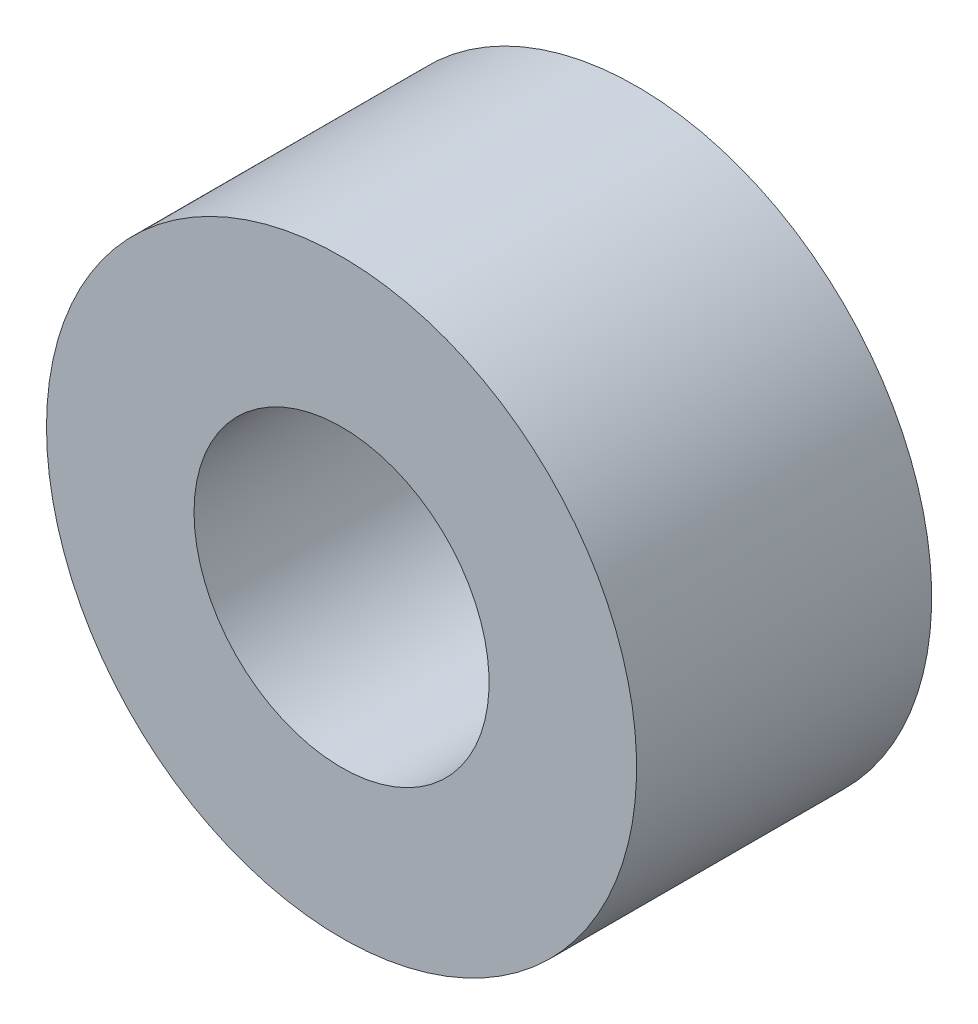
ISO-10303-21;
HEADER;
FILE_DESCRIPTION(('STEP AP214'),'2;1');
FILE_NAME('part.step','',(''),(''),'','','');
FILE_SCHEMA(('AUTOMOTIVE_DESIGN { 1 0 10303 214 1 1 1 1 }'));
ENDSEC;
DATA;
#1=APPLICATION_CONTEXT('core data for automotive mechanical design processes');
#2=APPLICATION_PROTOCOL_DEFINITION('international standard','automotive_design',2000,#1);
#3=PRODUCT_CONTEXT('',#1,'mechanical');
#4=PRODUCT('Part','Part','',(#3));
#5=PRODUCT_RELATED_PRODUCT_CATEGORY('part','',(#4));
#6=PRODUCT_DEFINITION_FORMATION('','',#4);
#7=PRODUCT_DEFINITION_CONTEXT('part definition',#1,'design');
#8=PRODUCT_DEFINITION('design','',#6,#7);
#9=PRODUCT_DEFINITION_SHAPE('','',#8);
#10=(LENGTH_UNIT() NAMED_UNIT(*) SI_UNIT(.MILLI.,.METRE.));
#11=(NAMED_UNIT(*) PLANE_ANGLE_UNIT() SI_UNIT($,.RADIAN.));
#12=(NAMED_UNIT(*) SI_UNIT($,.STERADIAN.) SOLID_ANGLE_UNIT());
#13=UNCERTAINTY_MEASURE_WITH_UNIT(LENGTH_MEASURE(1.E-05),#10,'distance_accuracy_value','');
#14=(GEOMETRIC_REPRESENTATION_CONTEXT(3) GLOBAL_UNCERTAINTY_ASSIGNED_CONTEXT((#13)) GLOBAL_UNIT_ASSIGNED_CONTEXT((#10,
#11,#12)) REPRESENTATION_CONTEXT('',''));
#15=CARTESIAN_POINT('',(0.,0.,0.));
#16=DIRECTION('',(0.,0.,1.));
#17=DIRECTION('',(1.,0.,0.));
#18=AXIS2_PLACEMENT_3D('',#15,#16,#17);
#19=CARTESIAN_POINT('',(0.,0.,1.5));
#20=DIRECTION('',(0.,0.,-1.));
#21=DIRECTION('',(-1.,0.,0.));
#22=AXIS2_PLACEMENT_3D('',#19,#20,#21);
#23=CYLINDRICAL_SURFACE('',#22,1.5);
#24=CARTESIAN_POINT('',(0.,0.,1.5));
#25=DIRECTION('',(0.,0.,-1.));
#26=DIRECTION('',(-1.,0.,0.));
#27=AXIS2_PLACEMENT_3D('',#24,#25,#26);
#28=CIRCLE('',#27,1.5);
#29=CARTESIAN_POINT('',(-1.5,0.,1.5));
#30=VERTEX_POINT('',#29);
#31=EDGE_CURVE('E19',#30,#30,#28,.F.);
#32=ORIENTED_EDGE('',*,*,#31,.F.);
#33=EDGE_LOOP('',(#32));
#34=FACE_BOUND('',#33,.T.);
#35=CARTESIAN_POINT('',(0.,0.,0.));
#36=DIRECTION('',(0.,0.,-1.));
#37=DIRECTION('',(-1.,0.,0.));
#38=AXIS2_PLACEMENT_3D('',#35,#36,#37);
#39=CIRCLE('',#38,1.5);
#40=CARTESIAN_POINT('',(-1.5,0.,0.));
#41=VERTEX_POINT('',#40);
#42=EDGE_CURVE('E28',#41,#41,#39,.F.);
#43=ORIENTED_EDGE('',*,*,#42,.T.);
#44=EDGE_LOOP('',(#43));
#45=FACE_BOUND('',#44,.T.);
#46=ADVANCED_FACE('F15',(#34,#45),#23,.T.);
#47=CARTESIAN_POINT('',(-1.518,-1.518,1.5));
#48=DIRECTION('',(0.,0.,1.));
#49=DIRECTION('',(1.,0.,0.));
#50=AXIS2_PLACEMENT_3D('',#47,#48,#49);
#51=PLANE('',#50);
#52=CARTESIAN_POINT('',(0.,0.,1.5));
#53=DIRECTION('',(0.,0.,-1.));
#54=DIRECTION('',(-1.,0.,0.));
#55=AXIS2_PLACEMENT_3D('',#52,#53,#54);
#56=CIRCLE('',#55,0.75);
#57=CARTESIAN_POINT('',(-0.75,0.,1.5));
#58=VERTEX_POINT('',#57);
#59=EDGE_CURVE('E23',#58,#58,#56,.F.);
#60=ORIENTED_EDGE('',*,*,#59,.F.);
#61=EDGE_LOOP('',(#60));
#62=FACE_BOUND('',#61,.T.);
#63=ORIENTED_EDGE('',*,*,#31,.T.);
#64=EDGE_LOOP('',(#63));
#65=FACE_BOUND('',#64,.T.);
#66=ADVANCED_FACE('F36',(#62,#65),#51,.T.);
#67=CARTESIAN_POINT('',(-1.518,-1.518,0.));
#68=DIRECTION('',(0.,0.,1.));
#69=DIRECTION('',(1.,0.,0.));
#70=AXIS2_PLACEMENT_3D('',#67,#68,#69);
#71=PLANE('',#70);
#72=CARTESIAN_POINT('',(0.,0.,0.));
#73=DIRECTION('',(0.,0.,-1.));
#74=DIRECTION('',(-1.,0.,0.));
#75=AXIS2_PLACEMENT_3D('',#72,#73,#74);
#76=CIRCLE('',#75,0.75);
#77=CARTESIAN_POINT('',(-0.75,0.,0.));
#78=VERTEX_POINT('',#77);
#79=EDGE_CURVE('E10',#78,#78,#76,.T.);
#80=ORIENTED_EDGE('',*,*,#79,.F.);
#81=EDGE_LOOP('',(#80));
#82=FACE_BOUND('',#81,.T.);
#83=ORIENTED_EDGE('',*,*,#42,.F.);
#84=EDGE_LOOP('',(#83));
#85=FACE_BOUND('',#84,.T.);
#86=ADVANCED_FACE('F17',(#82,#85),#71,.F.);
#87=CARTESIAN_POINT('',(0.,0.,1.5));
#88=DIRECTION('',(0.,0.,-1.));
#89=DIRECTION('',(-1.,0.,0.));
#90=AXIS2_PLACEMENT_3D('',#87,#88,#89);
#91=CYLINDRICAL_SURFACE('',#90,0.75);
#92=ORIENTED_EDGE('',*,*,#59,.T.);
#93=EDGE_LOOP('',(#92));
#94=FACE_BOUND('',#93,.T.);
#95=ORIENTED_EDGE('',*,*,#79,.T.);
#96=EDGE_LOOP('',(#95));
#97=FACE_BOUND('',#96,.T.);
#98=ADVANCED_FACE('F47',(#94,#97),#91,.F.);
#99=CLOSED_SHELL('',(#46,#66,#86,#98));
#100=MANIFOLD_SOLID_BREP('B1',#99);
#101=ADVANCED_BREP_SHAPE_REPRESENTATION('',(#18,#100),#14);
#102=SHAPE_DEFINITION_REPRESENTATION(#9,#101);
ENDSEC;
END-ISO-10303-21;
